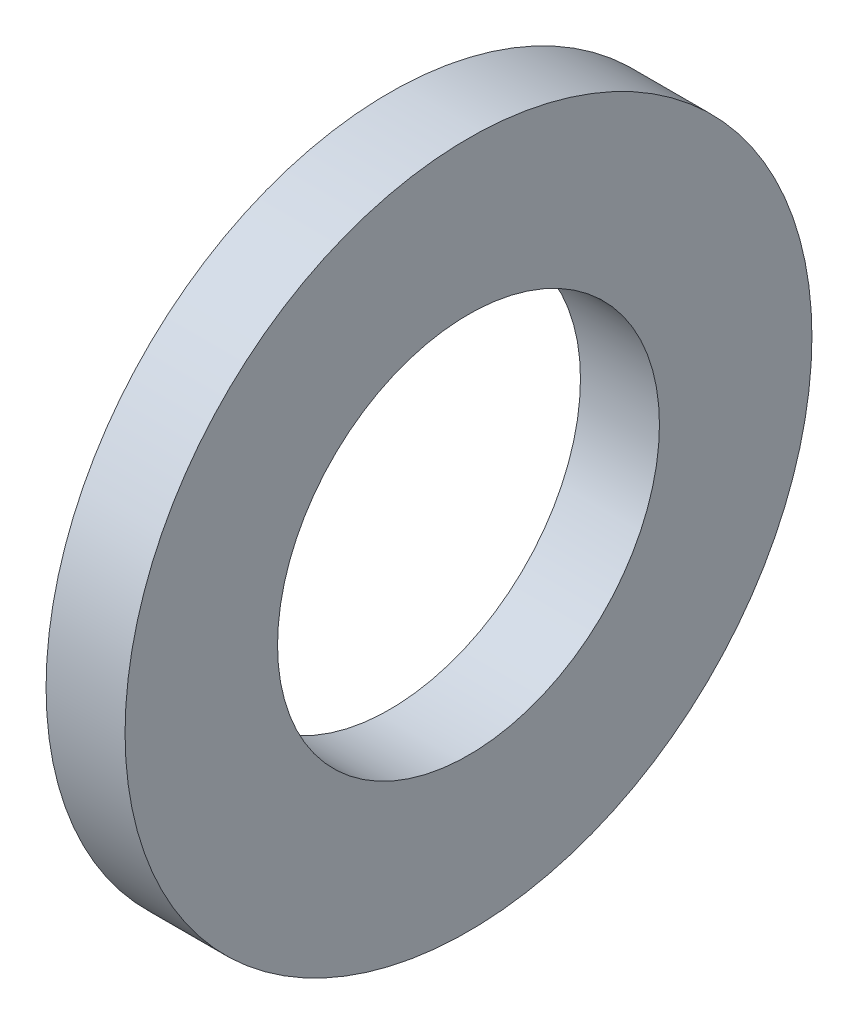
from build123d import *

# Parameters (mm, degrees)
SKETCH1_W = 2.3
SKETCH1_H = 4.44


with BuildPart() as part:
    # Sketch1 → Base-Revolve (revolve)
    with BuildSketch(Plane.XY, mode=Mode.PRIVATE) as base_revolve_sk:
        with Locations((-1.15, 7.78)):
            Rectangle(SKETCH1_W, SKETCH1_H)
    revolve(base_revolve_sk.sketch.rotate(Axis((-34.925, 0, 0), (1, 0, 0)), 90), axis=Axis((-34.925, 0, 0), (1, 0, 0)))


solid = part.part
